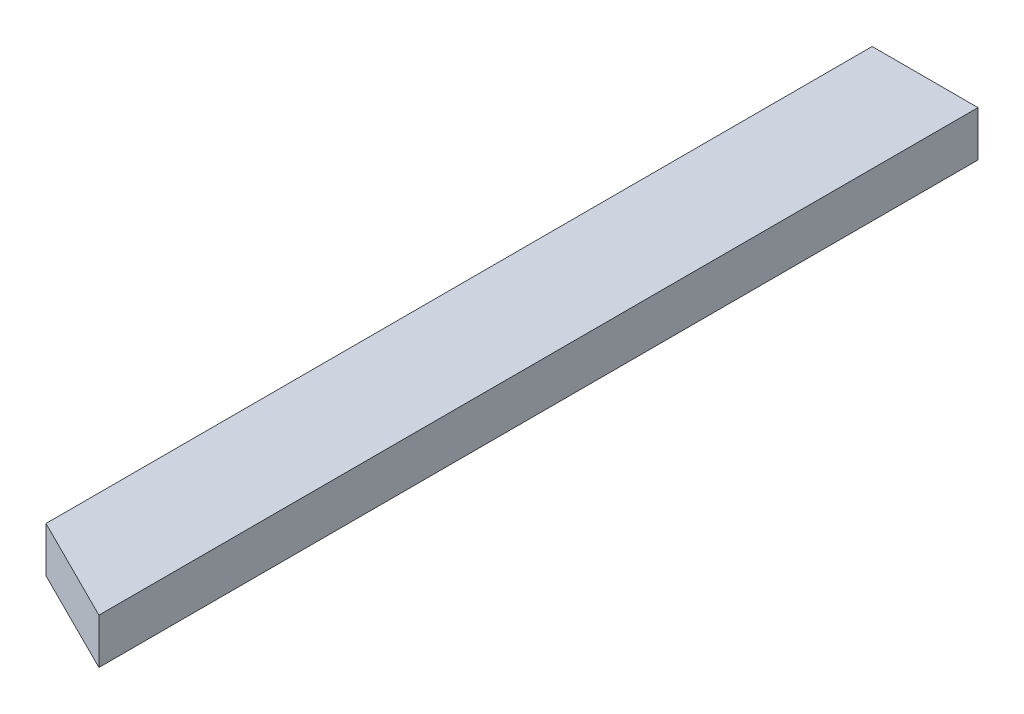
ISO-10303-21;
HEADER;
FILE_DESCRIPTION(('STEP AP214'),'2;1');
FILE_NAME('part.step','',(''),(''),'','','');
FILE_SCHEMA(('AUTOMOTIVE_DESIGN { 1 0 10303 214 1 1 1 1 }'));
ENDSEC;
DATA;
#1=APPLICATION_CONTEXT('core data for automotive mechanical design processes');
#2=APPLICATION_PROTOCOL_DEFINITION('international standard','automotive_design',2000,#1);
#3=PRODUCT_CONTEXT('',#1,'mechanical');
#4=PRODUCT('Part','Part','',(#3));
#5=PRODUCT_RELATED_PRODUCT_CATEGORY('part','',(#4));
#6=PRODUCT_DEFINITION_FORMATION('','',#4);
#7=PRODUCT_DEFINITION_CONTEXT('part definition',#1,'design');
#8=PRODUCT_DEFINITION('design','',#6,#7);
#9=PRODUCT_DEFINITION_SHAPE('','',#8);
#10=(LENGTH_UNIT() NAMED_UNIT(*) SI_UNIT(.MILLI.,.METRE.));
#11=(NAMED_UNIT(*) PLANE_ANGLE_UNIT() SI_UNIT($,.RADIAN.));
#12=(NAMED_UNIT(*) SI_UNIT($,.STERADIAN.) SOLID_ANGLE_UNIT());
#13=UNCERTAINTY_MEASURE_WITH_UNIT(LENGTH_MEASURE(1.E-05),#10,'distance_accuracy_value','');
#14=(GEOMETRIC_REPRESENTATION_CONTEXT(3) GLOBAL_UNCERTAINTY_ASSIGNED_CONTEXT((#13)) GLOBAL_UNIT_ASSIGNED_CONTEXT((#10,
#11,#12)) REPRESENTATION_CONTEXT('',''));
#15=CARTESIAN_POINT('',(0.,0.,0.));
#16=DIRECTION('',(0.,0.,1.));
#17=DIRECTION('',(1.,0.,0.));
#18=AXIS2_PLACEMENT_3D('',#15,#16,#17);
#19=CARTESIAN_POINT('',(-88.9,38.1,0.));
#20=DIRECTION('',(0.,0.,1.));
#21=DIRECTION('',(1.,0.,0.));
#22=AXIS2_PLACEMENT_3D('',#19,#20,#21);
#23=PLANE('',#22);
#24=DIRECTION('',(-1.,0.,0.));
#25=VECTOR('',#24,1.);
#26=CARTESIAN_POINT('',(-88.9,0.,0.));
#27=LINE('',#26,#25);
#28=CARTESIAN_POINT('',(0.,0.,0.));
#29=VERTEX_POINT('',#28);
#30=CARTESIAN_POINT('',(-88.9,0.,0.));
#31=VERTEX_POINT('',#30);
#32=EDGE_CURVE('E96',#29,#31,#27,.T.);
#33=ORIENTED_EDGE('',*,*,#32,.T.);
#34=DIRECTION('',(0.,-1.,0.));
#35=VECTOR('',#34,1.);
#36=CARTESIAN_POINT('',(-88.9,38.1,0.));
#37=LINE('',#36,#35);
#38=CARTESIAN_POINT('',(-88.9,38.1,0.));
#39=VERTEX_POINT('',#38);
#40=EDGE_CURVE('E11',#39,#31,#37,.T.);
#41=ORIENTED_EDGE('',*,*,#40,.F.);
#42=DIRECTION('',(-1.,0.,0.));
#43=VECTOR('',#42,1.);
#44=CARTESIAN_POINT('',(-88.9,38.1,0.));
#45=LINE('',#44,#43);
#46=CARTESIAN_POINT('',(0.,38.1,0.));
#47=VERTEX_POINT('',#46);
#48=EDGE_CURVE('E84',#47,#39,#45,.T.);
#49=ORIENTED_EDGE('',*,*,#48,.F.);
#50=DIRECTION('',(0.,-1.,0.));
#51=VECTOR('',#50,1.);
#52=CARTESIAN_POINT('',(0.,38.1,0.));
#53=LINE('',#52,#51);
#54=EDGE_CURVE('E92',#47,#29,#53,.T.);
#55=ORIENTED_EDGE('',*,*,#54,.T.);
#56=EDGE_LOOP('',(#33,#41,#49,#55));
#57=FACE_BOUND('',#56,.T.);
#58=ADVANCED_FACE('F33',(#57),#23,.F.);
#59=CARTESIAN_POINT('',(-88.9,38.1,693.918401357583));
#60=DIRECTION('',(1.,0.,0.));
#61=DIRECTION('',(0.,0.,-1.));
#62=AXIS2_PLACEMENT_3D('',#59,#60,#61);
#63=PLANE('',#62);
#64=DIRECTION('',(0.,0.,1.));
#65=VECTOR('',#64,1.);
#66=CARTESIAN_POINT('',(-88.9,0.,693.918401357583));
#67=LINE('',#66,#65);
#68=CARTESIAN_POINT('',(-88.9,0.,693.918401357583));
#69=VERTEX_POINT('',#68);
#70=EDGE_CURVE('E88',#31,#69,#67,.T.);
#71=ORIENTED_EDGE('',*,*,#70,.T.);
#72=DIRECTION('',(0.,-1.,0.));
#73=VECTOR('',#72,1.);
#74=CARTESIAN_POINT('',(-88.9,38.1,693.918401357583));
#75=LINE('',#74,#73);
#76=CARTESIAN_POINT('',(-88.9,38.1,693.918401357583));
#77=VERTEX_POINT('',#76);
#78=EDGE_CURVE('E41',#77,#69,#75,.T.);
#79=ORIENTED_EDGE('',*,*,#78,.F.);
#80=DIRECTION('',(0.,0.,1.));
#81=VECTOR('',#80,1.);
#82=CARTESIAN_POINT('',(-88.9,38.1,693.918401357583));
#83=LINE('',#82,#81);
#84=EDGE_CURVE('E79',#39,#77,#83,.T.);
#85=ORIENTED_EDGE('',*,*,#84,.F.);
#86=ORIENTED_EDGE('',*,*,#40,.T.);
#87=EDGE_LOOP('',(#71,#79,#85,#86));
#88=FACE_BOUND('',#87,.T.);
#89=ADVANCED_FACE('F87',(#88),#63,.F.);
#90=CARTESIAN_POINT('',(0.,38.1,738.378));
#91=DIRECTION('',(0.447290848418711,0.,-0.894388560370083));
#92=DIRECTION('',(-0.894388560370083,0.,-0.447290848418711));
#93=AXIS2_PLACEMENT_3D('',#90,#91,#92);
#94=PLANE('',#93);
#95=DIRECTION('',(0.894388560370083,0.,0.447290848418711));
#96=VECTOR('',#95,1.);
#97=CARTESIAN_POINT('',(0.,0.,738.378));
#98=LINE('',#97,#96);
#99=CARTESIAN_POINT('',(0.,0.,738.378));
#100=VERTEX_POINT('',#99);
#101=EDGE_CURVE('E66',#69,#100,#98,.T.);
#102=ORIENTED_EDGE('',*,*,#101,.T.);
#103=DIRECTION('',(0.,-1.,0.));
#104=VECTOR('',#103,1.);
#105=CARTESIAN_POINT('',(0.,38.1,738.378));
#106=LINE('',#105,#104);
#107=CARTESIAN_POINT('',(0.,38.1,738.378));
#108=VERTEX_POINT('',#107);
#109=EDGE_CURVE('E89',#108,#100,#106,.T.);
#110=ORIENTED_EDGE('',*,*,#109,.F.);
#111=DIRECTION('',(0.894388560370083,0.,0.447290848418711));
#112=VECTOR('',#111,1.);
#113=CARTESIAN_POINT('',(0.,38.1,738.378));
#114=LINE('',#113,#112);
#115=EDGE_CURVE('E82',#77,#108,#114,.T.);
#116=ORIENTED_EDGE('',*,*,#115,.F.);
#117=ORIENTED_EDGE('',*,*,#78,.T.);
#118=EDGE_LOOP('',(#102,#110,#116,#117));
#119=FACE_BOUND('',#118,.T.);
#120=ADVANCED_FACE('F90',(#119),#94,.F.);
#121=CARTESIAN_POINT('',(0.,38.1,0.));
#122=DIRECTION('',(-1.,0.,0.));
#123=DIRECTION('',(0.,0.,1.));
#124=AXIS2_PLACEMENT_3D('',#121,#122,#123);
#125=PLANE('',#124);
#126=DIRECTION('',(0.,0.,-1.));
#127=VECTOR('',#126,1.);
#128=CARTESIAN_POINT('',(0.,0.,0.));
#129=LINE('',#128,#127);
#130=EDGE_CURVE('E72',#100,#29,#129,.T.);
#131=ORIENTED_EDGE('',*,*,#130,.T.);
#132=ORIENTED_EDGE('',*,*,#54,.F.);
#133=DIRECTION('',(0.,0.,-1.));
#134=VECTOR('',#133,1.);
#135=CARTESIAN_POINT('',(0.,38.1,0.));
#136=LINE('',#135,#134);
#137=EDGE_CURVE('E49',#108,#47,#136,.T.);
#138=ORIENTED_EDGE('',*,*,#137,.F.);
#139=ORIENTED_EDGE('',*,*,#109,.T.);
#140=EDGE_LOOP('',(#131,#132,#138,#139));
#141=FACE_BOUND('',#140,.T.);
#142=ADVANCED_FACE('F103',(#141),#125,.F.);
#143=CARTESIAN_POINT('',(0.,38.1,0.));
#144=DIRECTION('',(0.,-1.,0.));
#145=DIRECTION('',(0.,0.,-1.));
#146=AXIS2_PLACEMENT_3D('',#143,#144,#145);
#147=PLANE('',#146);
#148=ORIENTED_EDGE('',*,*,#48,.T.);
#149=ORIENTED_EDGE('',*,*,#84,.T.);
#150=ORIENTED_EDGE('',*,*,#115,.T.);
#151=ORIENTED_EDGE('',*,*,#137,.T.);
#152=EDGE_LOOP('',(#148,#149,#150,#151));
#153=FACE_BOUND('',#152,.T.);
#154=ADVANCED_FACE('F80',(#153),#147,.F.);
#155=CARTESIAN_POINT('',(0.,0.,0.));
#156=DIRECTION('',(0.,-1.,0.));
#157=DIRECTION('',(0.,0.,-1.));
#158=AXIS2_PLACEMENT_3D('',#155,#156,#157);
#159=PLANE('',#158);
#160=ORIENTED_EDGE('',*,*,#32,.F.);
#161=ORIENTED_EDGE('',*,*,#130,.F.);
#162=ORIENTED_EDGE('',*,*,#101,.F.);
#163=ORIENTED_EDGE('',*,*,#70,.F.);
#164=EDGE_LOOP('',(#160,#161,#162,#163));
#165=FACE_BOUND('',#164,.T.);
#166=ADVANCED_FACE('F106',(#165),#159,.T.);
#167=CLOSED_SHELL('',(#58,#89,#120,#142,#154,#166));
#168=MANIFOLD_SOLID_BREP('B2',#167);
#169=ADVANCED_BREP_SHAPE_REPRESENTATION('',(#18,#168),#14);
#170=SHAPE_DEFINITION_REPRESENTATION(#9,#169);
ENDSEC;
END-ISO-10303-21;
